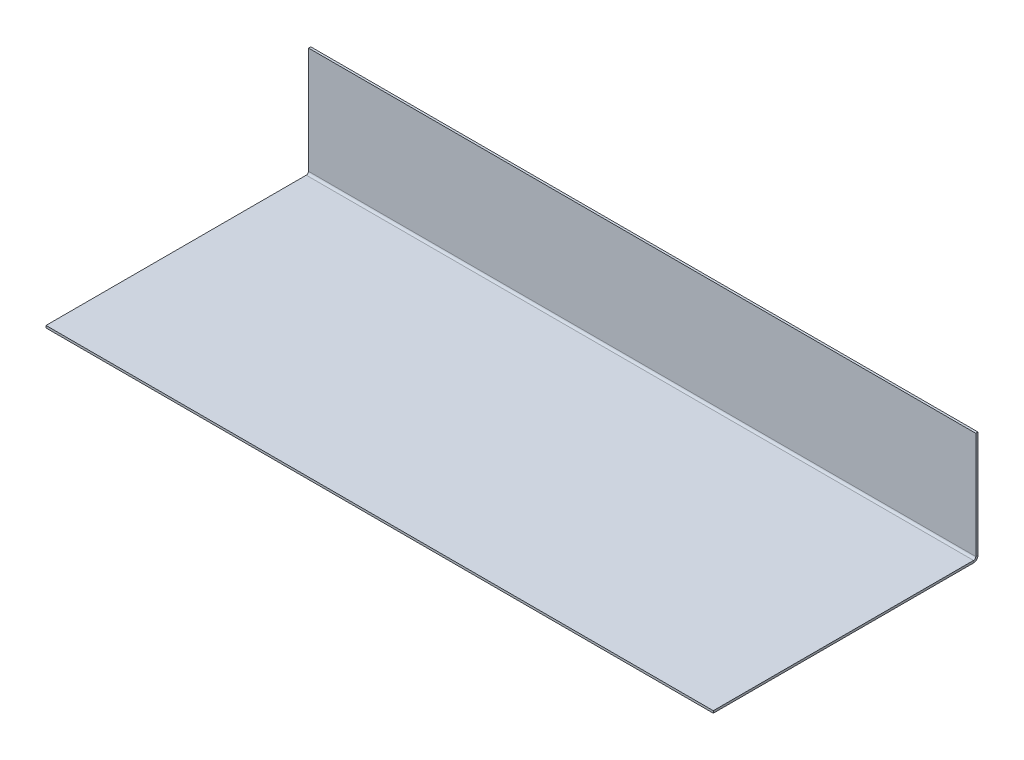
ISO-10303-21;
HEADER;
FILE_DESCRIPTION(('STEP AP214'),'2;1');
FILE_NAME('part.step','',(''),(''),'','','');
FILE_SCHEMA(('AUTOMOTIVE_DESIGN { 1 0 10303 214 1 1 1 1 }'));
ENDSEC;
DATA;
#1=APPLICATION_CONTEXT('core data for automotive mechanical design processes');
#2=APPLICATION_PROTOCOL_DEFINITION('international standard','automotive_design',2000,#1);
#3=PRODUCT_CONTEXT('',#1,'mechanical');
#4=PRODUCT('Part','Part','',(#3));
#5=PRODUCT_RELATED_PRODUCT_CATEGORY('part','',(#4));
#6=PRODUCT_DEFINITION_FORMATION('','',#4);
#7=PRODUCT_DEFINITION_CONTEXT('part definition',#1,'design');
#8=PRODUCT_DEFINITION('design','',#6,#7);
#9=PRODUCT_DEFINITION_SHAPE('','',#8);
#10=(LENGTH_UNIT() NAMED_UNIT(*) SI_UNIT(.MILLI.,.METRE.));
#11=(NAMED_UNIT(*) PLANE_ANGLE_UNIT() SI_UNIT($,.RADIAN.));
#12=(NAMED_UNIT(*) SI_UNIT($,.STERADIAN.) SOLID_ANGLE_UNIT());
#13=UNCERTAINTY_MEASURE_WITH_UNIT(LENGTH_MEASURE(1.E-05),#10,'distance_accuracy_value','');
#14=(GEOMETRIC_REPRESENTATION_CONTEXT(3) GLOBAL_UNCERTAINTY_ASSIGNED_CONTEXT((#13)) GLOBAL_UNIT_ASSIGNED_CONTEXT((#10,
#11,#12)) REPRESENTATION_CONTEXT('',''));
#15=CARTESIAN_POINT('',(0.,0.,0.));
#16=DIRECTION('',(0.,0.,1.));
#17=DIRECTION('',(1.,0.,0.));
#18=AXIS2_PLACEMENT_3D('',#15,#16,#17);
#19=CARTESIAN_POINT('',(150.,50.,608.631467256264));
#20=DIRECTION('',(1.,0.,0.));
#21=DIRECTION('',(0.,1.,0.));
#22=AXIS2_PLACEMENT_3D('',#19,#20,#21);
#23=PLANE('',#22);
#24=DIRECTION('',(0.,-1.,0.));
#25=VECTOR('',#24,1.);
#26=CARTESIAN_POINT('',(150.,1.,0.));
#27=LINE('',#26,#25);
#28=CARTESIAN_POINT('',(150.,50.,0.));
#29=VERTEX_POINT('',#28);
#30=CARTESIAN_POINT('',(150.,1.99999999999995,0.));
#31=VERTEX_POINT('',#30);
#32=EDGE_CURVE('E119',#29,#31,#27,.T.);
#33=ORIENTED_EDGE('',*,*,#32,.F.);
#34=DIRECTION('',(0.,0.,-1.));
#35=VECTOR('',#34,1.);
#36=CARTESIAN_POINT('',(150.,50.,608.631467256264));
#37=LINE('',#36,#35);
#38=CARTESIAN_POINT('',(150.,50.,1.));
#39=VERTEX_POINT('',#38);
#40=EDGE_CURVE('E33',#39,#29,#37,.T.);
#41=ORIENTED_EDGE('',*,*,#40,.F.);
#42=DIRECTION('',(0.,-1.,0.));
#43=VECTOR('',#42,1.);
#44=CARTESIAN_POINT('',(150.,50.,1.));
#45=LINE('',#44,#43);
#46=CARTESIAN_POINT('',(150.,1.99999999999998,1.));
#47=VERTEX_POINT('',#46);
#48=EDGE_CURVE('E45',#39,#47,#45,.T.);
#49=ORIENTED_EDGE('',*,*,#48,.T.);
#50=DIRECTION('',(0.,0.,-1.));
#51=VECTOR('',#50,1.);
#52=CARTESIAN_POINT('',(150.,2.,608.631467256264));
#53=LINE('',#52,#51);
#54=EDGE_CURVE('E11',#47,#31,#53,.T.);
#55=ORIENTED_EDGE('',*,*,#54,.T.);
#56=EDGE_LOOP('',(#33,#41,#49,#55));
#57=FACE_BOUND('',#56,.T.);
#58=ADVANCED_FACE('F26',(#57),#23,.T.);
#59=CARTESIAN_POINT('',(150.,50.,608.631467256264));
#60=DIRECTION('',(0.,1.,0.));
#61=DIRECTION('',(0.,0.,1.));
#62=AXIS2_PLACEMENT_3D('',#59,#60,#61);
#63=PLANE('',#62);
#64=DIRECTION('',(-1.,0.,0.));
#65=VECTOR('',#64,1.);
#66=CARTESIAN_POINT('',(150.,50.,0.));
#67=LINE('',#66,#65);
#68=CARTESIAN_POINT('',(-150.,50.,0.));
#69=VERTEX_POINT('',#68);
#70=EDGE_CURVE('E136',#29,#69,#67,.T.);
#71=ORIENTED_EDGE('',*,*,#70,.T.);
#72=DIRECTION('',(0.,0.,-1.));
#73=VECTOR('',#72,1.);
#74=CARTESIAN_POINT('',(-150.,50.,608.631467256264));
#75=LINE('',#74,#73);
#76=CARTESIAN_POINT('',(-150.,50.,0.999999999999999));
#77=VERTEX_POINT('',#76);
#78=EDGE_CURVE('E130',#77,#69,#75,.T.);
#79=ORIENTED_EDGE('',*,*,#78,.F.);
#80=DIRECTION('',(1.,0.,0.));
#81=VECTOR('',#80,1.);
#82=CARTESIAN_POINT('',(150.,50.,1.));
#83=LINE('',#82,#81);
#84=EDGE_CURVE('E40',#77,#39,#83,.T.);
#85=ORIENTED_EDGE('',*,*,#84,.T.);
#86=ORIENTED_EDGE('',*,*,#40,.T.);
#87=EDGE_LOOP('',(#71,#79,#85,#86));
#88=FACE_BOUND('',#87,.T.);
#89=ADVANCED_FACE('F134',(#88),#63,.T.);
#90=CARTESIAN_POINT('',(-150.,50.,608.631467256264));
#91=DIRECTION('',(1.,0.,0.));
#92=DIRECTION('',(0.,1.,0.));
#93=AXIS2_PLACEMENT_3D('',#90,#91,#92);
#94=PLANE('',#93);
#95=ORIENTED_EDGE('',*,*,#78,.T.);
#96=DIRECTION('',(0.,-1.,0.));
#97=VECTOR('',#96,1.);
#98=CARTESIAN_POINT('',(-150.,1.,0.));
#99=LINE('',#98,#97);
#100=CARTESIAN_POINT('',(-150.,2.,0.));
#101=VERTEX_POINT('',#100);
#102=EDGE_CURVE('E140',#69,#101,#99,.T.);
#103=ORIENTED_EDGE('',*,*,#102,.T.);
#104=DIRECTION('',(0.,0.,-1.));
#105=VECTOR('',#104,1.);
#106=CARTESIAN_POINT('',(-150.,2.,608.631467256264));
#107=LINE('',#106,#105);
#108=CARTESIAN_POINT('',(-150.,1.99999999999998,1.));
#109=VERTEX_POINT('',#108);
#110=EDGE_CURVE('E111',#109,#101,#107,.T.);
#111=ORIENTED_EDGE('',*,*,#110,.F.);
#112=DIRECTION('',(0.,-1.,0.));
#113=VECTOR('',#112,1.);
#114=CARTESIAN_POINT('',(-150.,50.,1.));
#115=LINE('',#114,#113);
#116=EDGE_CURVE('E109',#77,#109,#115,.T.);
#117=ORIENTED_EDGE('',*,*,#116,.F.);
#118=EDGE_LOOP('',(#95,#103,#111,#117));
#119=FACE_BOUND('',#118,.T.);
#120=ADVANCED_FACE('F139',(#119),#94,.F.);
#121=CARTESIAN_POINT('',(150.,50.,1.));
#122=DIRECTION('',(0.,0.,-1.));
#123=DIRECTION('',(-1.,0.,0.));
#124=AXIS2_PLACEMENT_3D('',#121,#122,#123);
#125=PLANE('',#124);
#126=ORIENTED_EDGE('',*,*,#116,.T.);
#127=DIRECTION('',(1.,0.,0.));
#128=VECTOR('',#127,1.);
#129=CARTESIAN_POINT('',(150.,2.,1.));
#130=LINE('',#129,#128);
#131=EDGE_CURVE('E101',#109,#47,#130,.T.);
#132=ORIENTED_EDGE('',*,*,#131,.T.);
#133=ORIENTED_EDGE('',*,*,#48,.F.);
#134=ORIENTED_EDGE('',*,*,#84,.F.);
#135=EDGE_LOOP('',(#126,#132,#133,#134));
#136=FACE_BOUND('',#135,.T.);
#137=ADVANCED_FACE('F108',(#136),#125,.F.);
#138=CARTESIAN_POINT('',(-150.,1.,0.));
#139=DIRECTION('',(0.,0.,1.));
#140=DIRECTION('',(1.,0.,0.));
#141=AXIS2_PLACEMENT_3D('',#138,#139,#140);
#142=PLANE('',#141);
#143=ORIENTED_EDGE('',*,*,#32,.T.);
#144=DIRECTION('',(-1.,0.,0.));
#145=VECTOR('',#144,1.);
#146=CARTESIAN_POINT('',(150.,2.,0.));
#147=LINE('',#146,#145);
#148=EDGE_CURVE('E115',#31,#101,#147,.T.);
#149=ORIENTED_EDGE('',*,*,#148,.T.);
#150=ORIENTED_EDGE('',*,*,#102,.F.);
#151=ORIENTED_EDGE('',*,*,#70,.F.);
#152=EDGE_LOOP('',(#143,#149,#150,#151));
#153=FACE_BOUND('',#152,.T.);
#154=ADVANCED_FACE('F189',(#153),#142,.F.);
#155=CARTESIAN_POINT('',(-150.,645.015527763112,119.));
#156=DIRECTION('',(0.,0.,-1.));
#157=DIRECTION('',(-1.,0.,0.));
#158=AXIS2_PLACEMENT_3D('',#155,#156,#157);
#159=PLANE('',#158);
#160=DIRECTION('',(0.,-1.,0.));
#161=VECTOR('',#160,1.);
#162=CARTESIAN_POINT('',(-150.,645.015527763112,119.));
#163=LINE('',#162,#161);
#164=CARTESIAN_POINT('',(-150.,1.,119.));
#165=VERTEX_POINT('',#164);
#166=CARTESIAN_POINT('',(-150.,0.,119.));
#167=VERTEX_POINT('',#166);
#168=EDGE_CURVE('E181',#165,#167,#163,.T.);
#169=ORIENTED_EDGE('',*,*,#168,.T.);
#170=DIRECTION('',(1.,0.,0.));
#171=VECTOR('',#170,1.);
#172=CARTESIAN_POINT('',(-150.,0.,119.));
#173=LINE('',#172,#171);
#174=CARTESIAN_POINT('',(150.,0.,119.));
#175=VERTEX_POINT('',#174);
#176=EDGE_CURVE('E176',#167,#175,#173,.T.);
#177=ORIENTED_EDGE('',*,*,#176,.T.);
#178=DIRECTION('',(0.,-1.,0.));
#179=VECTOR('',#178,1.);
#180=CARTESIAN_POINT('',(150.,645.015527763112,119.));
#181=LINE('',#180,#179);
#182=CARTESIAN_POINT('',(150.,1.,119.));
#183=VERTEX_POINT('',#182);
#184=EDGE_CURVE('E157',#183,#175,#181,.T.);
#185=ORIENTED_EDGE('',*,*,#184,.F.);
#186=DIRECTION('',(1.,0.,0.));
#187=VECTOR('',#186,1.);
#188=CARTESIAN_POINT('',(-150.,1.,119.));
#189=LINE('',#188,#187);
#190=EDGE_CURVE('E164',#165,#183,#189,.T.);
#191=ORIENTED_EDGE('',*,*,#190,.F.);
#192=EDGE_LOOP('',(#169,#177,#185,#191));
#193=FACE_BOUND('',#192,.T.);
#194=ADVANCED_FACE('F199',(#193),#159,.F.);
#195=CARTESIAN_POINT('',(-150.,1.,119.));
#196=DIRECTION('',(0.,1.,0.));
#197=DIRECTION('',(0.,0.,1.));
#198=AXIS2_PLACEMENT_3D('',#195,#196,#197);
#199=PLANE('',#198);
#200=DIRECTION('',(0.,0.,-1.));
#201=VECTOR('',#200,1.);
#202=CARTESIAN_POINT('',(150.,1.,0.));
#203=LINE('',#202,#201);
#204=CARTESIAN_POINT('',(150.,1.,2.));
#205=VERTEX_POINT('',#204);
#206=EDGE_CURVE('E173',#183,#205,#203,.T.);
#207=ORIENTED_EDGE('',*,*,#206,.T.);
#208=DIRECTION('',(-1.,0.,0.));
#209=VECTOR('',#208,1.);
#210=CARTESIAN_POINT('',(150.,1.,2.));
#211=LINE('',#210,#209);
#212=CARTESIAN_POINT('',(-150.,1.,2.));
#213=VERTEX_POINT('',#212);
#214=EDGE_CURVE('E104',#205,#213,#211,.T.);
#215=ORIENTED_EDGE('',*,*,#214,.T.);
#216=DIRECTION('',(0.,0.,1.));
#217=VECTOR('',#216,1.);
#218=CARTESIAN_POINT('',(-150.,1.,0.));
#219=LINE('',#218,#217);
#220=EDGE_CURVE('E167',#213,#165,#219,.T.);
#221=ORIENTED_EDGE('',*,*,#220,.T.);
#222=ORIENTED_EDGE('',*,*,#190,.T.);
#223=EDGE_LOOP('',(#207,#215,#221,#222));
#224=FACE_BOUND('',#223,.T.);
#225=ADVANCED_FACE('F204',(#224),#199,.T.);
#226=CARTESIAN_POINT('',(-150.,645.015527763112,0.));
#227=DIRECTION('',(1.,0.,0.));
#228=DIRECTION('',(0.,0.,-1.));
#229=AXIS2_PLACEMENT_3D('',#226,#227,#228);
#230=PLANE('',#229);
#231=DIRECTION('',(0.,-1.,0.));
#232=VECTOR('',#231,1.);
#233=CARTESIAN_POINT('',(-150.,645.015527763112,2.));
#234=LINE('',#233,#232);
#235=CARTESIAN_POINT('',(-150.,0.,2.));
#236=VERTEX_POINT('',#235);
#237=EDGE_CURVE('E147',#213,#236,#234,.T.);
#238=ORIENTED_EDGE('',*,*,#237,.T.);
#239=DIRECTION('',(0.,0.,1.));
#240=VECTOR('',#239,1.);
#241=CARTESIAN_POINT('',(-150.,0.,0.));
#242=LINE('',#241,#240);
#243=EDGE_CURVE('E160',#236,#167,#242,.T.);
#244=ORIENTED_EDGE('',*,*,#243,.T.);
#245=ORIENTED_EDGE('',*,*,#168,.F.);
#246=ORIENTED_EDGE('',*,*,#220,.F.);
#247=EDGE_LOOP('',(#238,#244,#245,#246));
#248=FACE_BOUND('',#247,.T.);
#249=ADVANCED_FACE('F202',(#248),#230,.F.);
#250=CARTESIAN_POINT('',(-150.,0.,119.));
#251=DIRECTION('',(0.,1.,0.));
#252=DIRECTION('',(0.,0.,1.));
#253=AXIS2_PLACEMENT_3D('',#250,#251,#252);
#254=PLANE('',#253);
#255=DIRECTION('',(-1.,0.,0.));
#256=VECTOR('',#255,1.);
#257=CARTESIAN_POINT('',(150.,0.,2.));
#258=LINE('',#257,#256);
#259=CARTESIAN_POINT('',(150.,0.,2.));
#260=VERTEX_POINT('',#259);
#261=EDGE_CURVE('E184',#260,#236,#258,.T.);
#262=ORIENTED_EDGE('',*,*,#261,.F.);
#263=DIRECTION('',(0.,0.,-1.));
#264=VECTOR('',#263,1.);
#265=CARTESIAN_POINT('',(150.,0.,0.));
#266=LINE('',#265,#264);
#267=EDGE_CURVE('E154',#175,#260,#266,.T.);
#268=ORIENTED_EDGE('',*,*,#267,.F.);
#269=ORIENTED_EDGE('',*,*,#176,.F.);
#270=ORIENTED_EDGE('',*,*,#243,.F.);
#271=EDGE_LOOP('',(#262,#268,#269,#270));
#272=FACE_BOUND('',#271,.T.);
#273=ADVANCED_FACE('F194',(#272),#254,.F.);
#274=CARTESIAN_POINT('',(150.,645.015527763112,0.));
#275=DIRECTION('',(-1.,0.,0.));
#276=DIRECTION('',(0.,0.,1.));
#277=AXIS2_PLACEMENT_3D('',#274,#275,#276);
#278=PLANE('',#277);
#279=ORIENTED_EDGE('',*,*,#184,.T.);
#280=ORIENTED_EDGE('',*,*,#267,.T.);
#281=DIRECTION('',(0.,-1.,0.));
#282=VECTOR('',#281,1.);
#283=CARTESIAN_POINT('',(150.,645.015527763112,2.));
#284=LINE('',#283,#282);
#285=EDGE_CURVE('E153',#205,#260,#284,.T.);
#286=ORIENTED_EDGE('',*,*,#285,.F.);
#287=ORIENTED_EDGE('',*,*,#206,.F.);
#288=EDGE_LOOP('',(#279,#280,#286,#287));
#289=FACE_BOUND('',#288,.T.);
#290=ADVANCED_FACE('F196',(#289),#278,.F.);
#291=CARTESIAN_POINT('',(-150.,2.,2.));
#292=DIRECTION('',(-1.,0.,0.));
#293=DIRECTION('',(0.,0.,1.));
#294=AXIS2_PLACEMENT_3D('',#291,#292,#293);
#295=PLANE('',#294);
#296=ORIENTED_EDGE('',*,*,#237,.F.);
#297=CARTESIAN_POINT('',(-150.,2.,2.));
#298=DIRECTION('',(-1.,0.,0.));
#299=DIRECTION('',(0.,0.,1.));
#300=AXIS2_PLACEMENT_3D('',#297,#298,#299);
#301=CIRCLE('',#300,1.);
#302=EDGE_CURVE('E106',#213,#109,#301,.F.);
#303=ORIENTED_EDGE('',*,*,#302,.T.);
#304=ORIENTED_EDGE('',*,*,#110,.T.);
#305=CARTESIAN_POINT('',(-150.,2.,2.));
#306=DIRECTION('',(-1.,0.,0.));
#307=DIRECTION('',(0.,0.,1.));
#308=AXIS2_PLACEMENT_3D('',#305,#306,#307);
#309=CIRCLE('',#308,1.99999999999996);
#310=EDGE_CURVE('E144',#236,#101,#309,.F.);
#311=ORIENTED_EDGE('',*,*,#310,.F.);
#312=EDGE_LOOP('',(#296,#303,#304,#311));
#313=FACE_BOUND('',#312,.T.);
#314=ADVANCED_FACE('F143',(#313),#295,.T.);
#315=CARTESIAN_POINT('',(150.,2.,2.));
#316=DIRECTION('',(1.,0.,0.));
#317=DIRECTION('',(0.,0.,-1.));
#318=AXIS2_PLACEMENT_3D('',#315,#316,#317);
#319=PLANE('',#318);
#320=ORIENTED_EDGE('',*,*,#54,.F.);
#321=CARTESIAN_POINT('',(150.,2.,2.));
#322=DIRECTION('',(-1.,0.,0.));
#323=DIRECTION('',(0.,0.,1.));
#324=AXIS2_PLACEMENT_3D('',#321,#322,#323);
#325=CIRCLE('',#324,1.);
#326=EDGE_CURVE('E91',#47,#205,#325,.T.);
#327=ORIENTED_EDGE('',*,*,#326,.T.);
#328=ORIENTED_EDGE('',*,*,#285,.T.);
#329=CARTESIAN_POINT('',(150.,2.,2.));
#330=DIRECTION('',(-1.,0.,0.));
#331=DIRECTION('',(0.,0.,1.));
#332=AXIS2_PLACEMENT_3D('',#329,#330,#331);
#333=CIRCLE('',#332,1.99999999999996);
#334=EDGE_CURVE('E94',#31,#260,#333,.T.);
#335=ORIENTED_EDGE('',*,*,#334,.F.);
#336=EDGE_LOOP('',(#320,#327,#328,#335));
#337=FACE_BOUND('',#336,.T.);
#338=ADVANCED_FACE('F90',(#337),#319,.T.);
#339=CARTESIAN_POINT('',(493.524519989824,2.,2.));
#340=DIRECTION('',(-1.,0.,0.));
#341=DIRECTION('',(0.,0.,1.));
#342=AXIS2_PLACEMENT_3D('',#339,#340,#341);
#343=CYLINDRICAL_SURFACE('',#342,1.99999999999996);
#344=ORIENTED_EDGE('',*,*,#334,.T.);
#345=ORIENTED_EDGE('',*,*,#261,.T.);
#346=ORIENTED_EDGE('',*,*,#310,.T.);
#347=ORIENTED_EDGE('',*,*,#148,.F.);
#348=EDGE_LOOP('',(#344,#345,#346,#347));
#349=FACE_BOUND('',#348,.T.);
#350=ADVANCED_FACE('F191',(#349),#343,.T.);
#351=CARTESIAN_POINT('',(493.524519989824,2.,2.));
#352=DIRECTION('',(-1.,0.,0.));
#353=DIRECTION('',(0.,0.,1.));
#354=AXIS2_PLACEMENT_3D('',#351,#352,#353);
#355=CYLINDRICAL_SURFACE('',#354,1.);
#356=ORIENTED_EDGE('',*,*,#326,.F.);
#357=ORIENTED_EDGE('',*,*,#131,.F.);
#358=ORIENTED_EDGE('',*,*,#302,.F.);
#359=ORIENTED_EDGE('',*,*,#214,.F.);
#360=EDGE_LOOP('',(#356,#357,#358,#359));
#361=FACE_BOUND('',#360,.T.);
#362=ADVANCED_FACE('F99',(#361),#355,.F.);
#363=CLOSED_SHELL('',(#58,#89,#120,#137,#154,#194,#225,#249,#273,#290,#314,#338,#350,#362));
#364=MANIFOLD_SOLID_BREP('B2',#363);
#365=ADVANCED_BREP_SHAPE_REPRESENTATION('',(#18,#364),#14);
#366=SHAPE_DEFINITION_REPRESENTATION(#9,#365);
ENDSEC;
END-ISO-10303-21;
